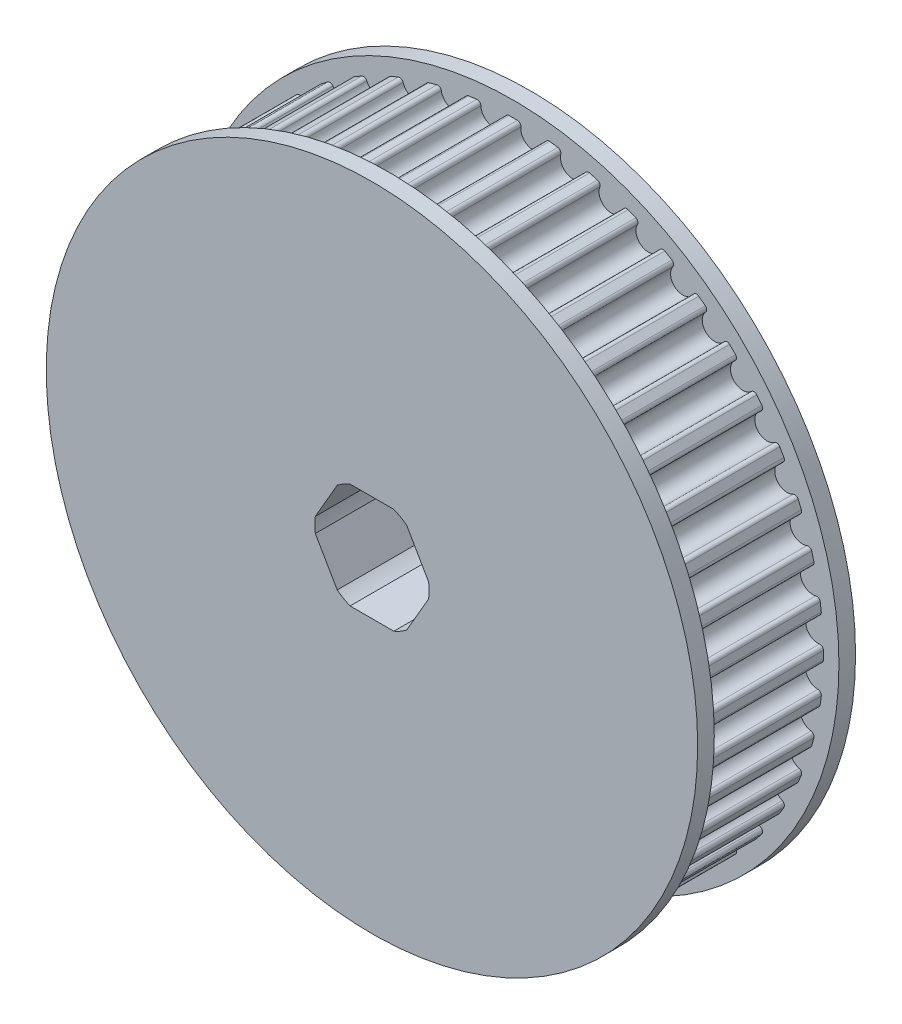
from build123d import *

# Parameters (mm, degrees)
SKETCH2_R               = 38.197186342
PD_DEPTH                = 7.5
TEETH_DEPTH             = 15
CIRPATTERN1_COUNT       = 48
SKETCH4_R               = 39.197186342
FLANGE_DEPTH            = 2
CUT_EXTRUDE2_DEPTH      = 57.241344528
CUT_EXTRUDE2_DEPTH_BACK = 57.241344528


with BuildPart() as part:
    # Sketch2 → PD (new, symmetric)
    with BuildSketch(Plane.XY):
        Circle(SKETCH2_R)
    extrude(amount=PD_DEPTH, both=True)

    # Sketch3 → Teeth (cut)
    with BuildSketch(Plane.XY.offset(7.5)):
        with BuildLine():
            Line((0, 37.327186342), (0.496531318, 37.327186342))
            ThreePointArc((0.496531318, 37.327186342), (0.817437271, 37.183401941), (0.923732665, 36.848206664))
            ThreePointArc((0.923732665, 36.848206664), (2.306584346, 35.191676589), (3.893826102, 36.653536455))
            ThreePointArc((3.893826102, 36.653536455), (4.042963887, 36.971989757), (4.379892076, 37.072657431))
            Line((4.379892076, 37.072657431), (4.8721755, 37.007847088))
            Line((4.8721755, 37.007847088), (4.985733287, 37.870404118))
            ThreePointArc((4.985733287, 37.870404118), (2.498215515, 38.115403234), (0, 38.197186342))
            Line((0, 38.197186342), (0, 37.327186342))
        make_face()
    teeth = extrude(amount=-TEETH_DEPTH, mode=Mode.SUBTRACT)

    # CirPattern1: Teeth ×48 about axis
    cirpattern1_axis = Axis((0, 0, 0), (0, 0, 1))
    for i in range(1, CIRPATTERN1_COUNT):
        add(teeth.rotate(cirpattern1_axis, i * 360 / CIRPATTERN1_COUNT), mode=Mode.SUBTRACT)

    # Sketch4 → Flange (add)
    with BuildSketch(Plane.XY.offset(7.5)):
        Circle(SKETCH4_R)
    flange = extrude(amount=FLANGE_DEPTH)

    # Flange 2: Flange across plane
    add(flange.mirror(Plane.XY))

    # Sketch6 → Cut-Extrude2 (cut, two sides: drawn at the far end of the back side and taken through both)
    with BuildSketch(Plane.XY.offset(-CUT_EXTRUDE2_DEPTH_BACK)):
        with BuildLine():
            Line((6.816751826, 0.893039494), (4.181770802, 5.456960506))
            ThreePointArc((4.181770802, 5.456960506), (3.4375, 5.953924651), (2.634981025, 6.35))
            Line((2.634981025, 6.35), (-2.634981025, 6.35))
            ThreePointArc((-2.634981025, 6.35), (-3.4375, 5.953924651), (-4.181770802, 5.456960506))
            Line((-4.181770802, 5.456960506), (-6.816751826, 0.893039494))
            ThreePointArc((-6.816751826, 0.893039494), (-6.875, 0), (-6.816751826, -0.893039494))
            Line((-6.816751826, -0.893039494), (-4.181770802, -5.456960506))
            ThreePointArc((-4.181770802, -5.456960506), (-3.4375, -5.953924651), (-2.634981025, -6.35))
            Line((-2.634981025, -6.35), (2.634981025, -6.35))
            ThreePointArc((2.634981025, -6.35), (3.4375, -5.953924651), (4.181770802, -5.456960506))
            Line((4.181770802, -5.456960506), (6.816751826, -0.893039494))
            ThreePointArc((6.816751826, -0.893039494), (6.875, 0), (6.816751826, 0.893039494))
        make_face()
    extrude(amount=CUT_EXTRUDE2_DEPTH + CUT_EXTRUDE2_DEPTH_BACK, mode=Mode.SUBTRACT)


solid = part.part
